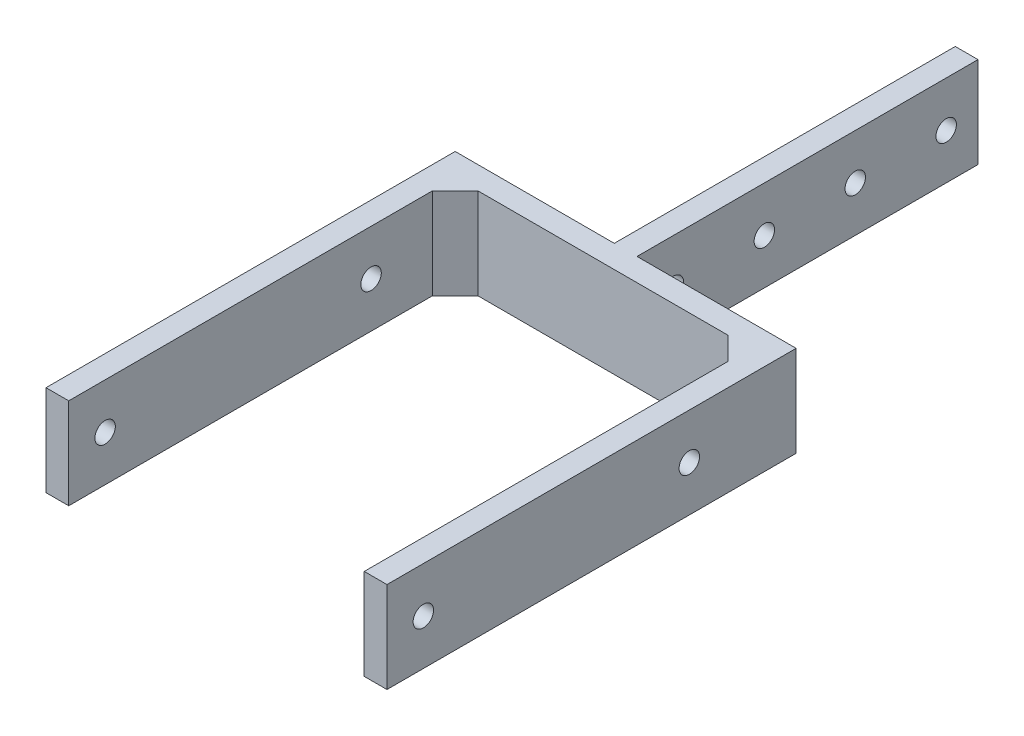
from build123d import *

# Parameters (mm, degrees)
SKETCH8_W           = 75
SKETCH8_H           = 90
BOSS_EXTRUDE6_DEPTH = 20
SKETCH9_W           = 65
SKETCH9_H           = 85
CUT_EXTRUDE3_DEPTH  = 119.84864324
SKETCH10_R          = 2.25
CUT_EXTRUDE4_DEPTH  = 119.84864324
LPATTERN2_COUNT     = 2
LPATTERN2_PITCH     = 58.5
CHAMFER1_SIZE       = 5
SKETCH11_W          = 5
SKETCH11_H          = 20
BOSS_EXTRUDE7_DEPTH = 75
SKETCH12_R          = 2.25
CUT_EXTRUDE5_DEPTH  = 171.953209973
LPATTERN3_COUNT     = 4
LPATTERN3_PITCH     = 20


with BuildPart() as part:
    # Sketch8 → Boss-Extrude6 (new body)
    with BuildSketch(Plane(origin=(0, 0, 0), x_dir=(1, 0, 0), z_dir=(0, 1, 0))):
        with Locations((37.5, 45)):
            Rectangle(SKETCH8_W, SKETCH8_H)
    extrude(amount=BOSS_EXTRUDE6_DEPTH)

    # Sketch9 → Cut-Extrude3 (cut, through all)
    with BuildSketch(Plane(origin=(0, 20, 0), x_dir=(1, 0, 0), z_dir=(0, 1, 0))):
        with Locations((37.5, 42.5)):
            Rectangle(SKETCH9_W, SKETCH9_H)
    extrude(amount=-CUT_EXTRUDE3_DEPTH, mode=Mode.SUBTRACT)

    # Sketch10 → Cut-Extrude4 (cut, through all)
    with BuildSketch(Plane.ZY):
        with Locations((-8, 10)):
            Circle(SKETCH10_R)
    cut_extrude4 = extrude(amount=-CUT_EXTRUDE4_DEPTH, mode=Mode.SUBTRACT)

    # LPattern2: Cut-Extrude4 ×2
    with Locations(*[(0, 0, -i * LPATTERN2_PITCH) for i in range(1, LPATTERN2_COUNT)]):
        add(cut_extrude4, mode=Mode.SUBTRACT)

    # Chamfer1
    chamfer1_edges = [part.edges().sort_by_distance(p)[0] for p in [
        (5, 10, -85),
        (70, 10, -85),
    ]]
    chamfer(chamfer1_edges, length=CHAMFER1_SIZE)

    # Sketch11 → Boss-Extrude7 (add)
    with BuildSketch(Plane(origin=(0, 0, -90), x_dir=(-1, 0, 0), z_dir=(0, 0, -1))):
        with Locations((-37.5, 10)):
            Rectangle(SKETCH11_W, SKETCH11_H)
    extrude(amount=BOSS_EXTRUDE7_DEPTH)

    # Sketch12 → Cut-Extrude5 (cut, through all)
    with BuildSketch(Plane.ZY.offset(-35)):
        with Locations(Location((-158, 10, 0), (0, 0, 270))):
            Circle(SKETCH12_R)
    cut_extrude5 = extrude(amount=-CUT_EXTRUDE5_DEPTH, mode=Mode.SUBTRACT)

    # LPattern3: Cut-Extrude5 ×4
    with Locations(*[(0, 0, i * LPATTERN3_PITCH) for i in range(1, LPATTERN3_COUNT)]):
        add(cut_extrude5, mode=Mode.SUBTRACT)


solid = part.part
